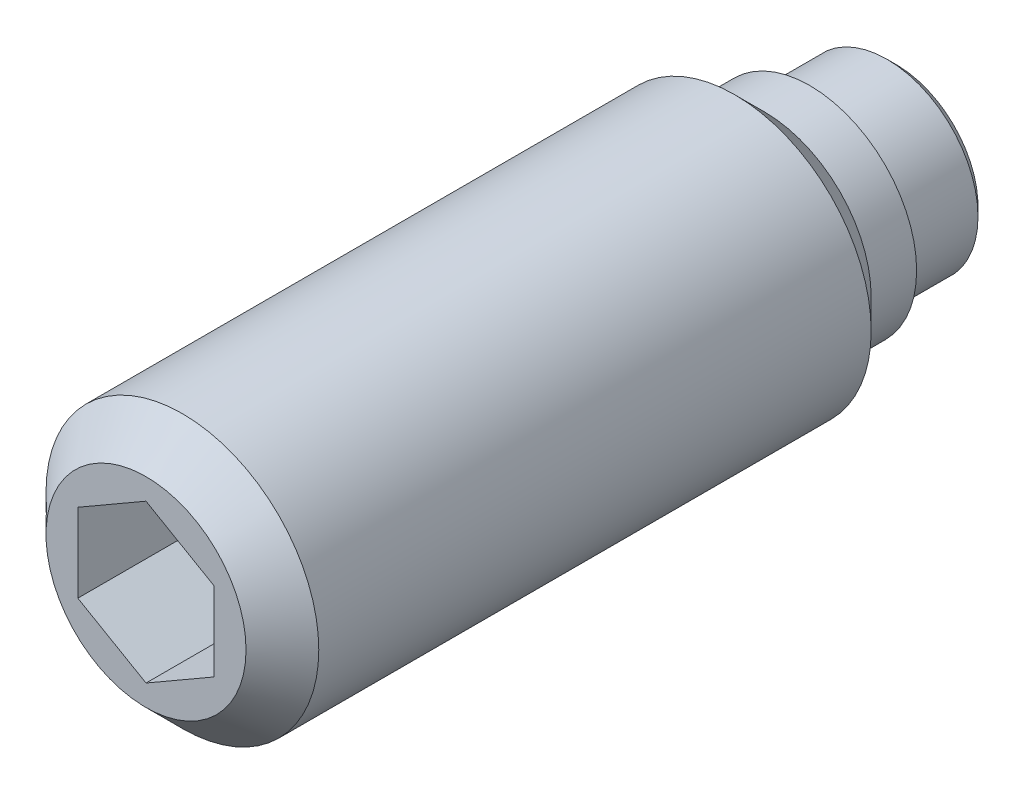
ISO-10303-21;
HEADER;
FILE_DESCRIPTION(('STEP AP214'),'2;1');
FILE_NAME('part.step','',(''),(''),'','','');
FILE_SCHEMA(('AUTOMOTIVE_DESIGN { 1 0 10303 214 1 1 1 1 }'));
ENDSEC;
DATA;
#1=APPLICATION_CONTEXT('core data for automotive mechanical design processes');
#2=APPLICATION_PROTOCOL_DEFINITION('international standard','automotive_design',2000,#1);
#3=PRODUCT_CONTEXT('',#1,'mechanical');
#4=PRODUCT('Part','Part','',(#3));
#5=PRODUCT_RELATED_PRODUCT_CATEGORY('part','',(#4));
#6=PRODUCT_DEFINITION_FORMATION('','',#4);
#7=PRODUCT_DEFINITION_CONTEXT('part definition',#1,'design');
#8=PRODUCT_DEFINITION('design','',#6,#7);
#9=PRODUCT_DEFINITION_SHAPE('','',#8);
#10=(LENGTH_UNIT() NAMED_UNIT(*) SI_UNIT(.MILLI.,.METRE.));
#11=(NAMED_UNIT(*) PLANE_ANGLE_UNIT() SI_UNIT($,.RADIAN.));
#12=(NAMED_UNIT(*) SI_UNIT($,.STERADIAN.) SOLID_ANGLE_UNIT());
#13=UNCERTAINTY_MEASURE_WITH_UNIT(LENGTH_MEASURE(1.E-05),#10,'distance_accuracy_value','');
#14=(GEOMETRIC_REPRESENTATION_CONTEXT(3) GLOBAL_UNCERTAINTY_ASSIGNED_CONTEXT((#13)) GLOBAL_UNIT_ASSIGNED_CONTEXT((#10,
#11,#12)) REPRESENTATION_CONTEXT('',''));
#15=CARTESIAN_POINT('',(0.,0.,0.));
#16=DIRECTION('',(0.,0.,1.));
#17=DIRECTION('',(1.,0.,0.));
#18=AXIS2_PLACEMENT_3D('',#15,#16,#17);
#19=CARTESIAN_POINT('',(0.,0.,1.9));
#20=DIRECTION('',(0.,0.,-1.));
#21=DIRECTION('',(-1.,0.,0.));
#22=AXIS2_PLACEMENT_3D('',#19,#20,#21);
#23=CYLINDRICAL_SURFACE('',#22,3.);
#24=CARTESIAN_POINT('',(0.,0.,15.7));
#25=DIRECTION('',(0.,0.,1.));
#26=DIRECTION('',(1.,0.,0.));
#27=AXIS2_PLACEMENT_3D('',#24,#25,#26);
#28=CIRCLE('',#27,3.);
#29=CARTESIAN_POINT('',(3.,0.,15.7));
#30=VERTEX_POINT('',#29);
#31=EDGE_CURVE('E9',#30,#30,#28,.F.);
#32=ORIENTED_EDGE('',*,*,#31,.T.);
#33=EDGE_LOOP('',(#32));
#34=FACE_BOUND('',#33,.T.);
#35=CARTESIAN_POINT('',(0.,0.,3.55));
#36=DIRECTION('',(0.,0.,-1.));
#37=DIRECTION('',(-1.,0.,0.));
#38=AXIS2_PLACEMENT_3D('',#35,#36,#37);
#39=CIRCLE('',#38,3.);
#40=CARTESIAN_POINT('',(-3.,0.,3.55));
#41=VERTEX_POINT('',#40);
#42=EDGE_CURVE('E74',#41,#41,#39,.T.);
#43=ORIENTED_EDGE('',*,*,#42,.F.);
#44=EDGE_LOOP('',(#43));
#45=FACE_BOUND('',#44,.T.);
#46=ADVANCED_FACE('F14',(#34,#45),#23,.T.);
#47=CARTESIAN_POINT('',(0.,0.,3.55));
#48=DIRECTION('',(0.,0.,1.));
#49=DIRECTION('',(1.,0.,0.));
#50=AXIS2_PLACEMENT_3D('',#47,#48,#49);
#51=CONICAL_SURFACE('',#50,3.,0.785398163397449);
#52=ORIENTED_EDGE('',*,*,#42,.T.);
#53=EDGE_LOOP('',(#52));
#54=FACE_BOUND('',#53,.T.);
#55=CARTESIAN_POINT('',(0.,0.,2.9));
#56=DIRECTION('',(0.,0.,-1.));
#57=DIRECTION('',(-1.,0.,0.));
#58=AXIS2_PLACEMENT_3D('',#55,#56,#57);
#59=CIRCLE('',#58,2.35);
#60=CARTESIAN_POINT('',(-2.35,0.,2.9));
#61=VERTEX_POINT('',#60);
#62=EDGE_CURVE('E112',#61,#61,#59,.T.);
#63=ORIENTED_EDGE('',*,*,#62,.F.);
#64=EDGE_LOOP('',(#63));
#65=FACE_BOUND('',#64,.T.);
#66=ADVANCED_FACE('F130',(#54,#65),#51,.T.);
#67=CARTESIAN_POINT('',(0.,0.,1.9));
#68=DIRECTION('',(0.,0.,-1.));
#69=DIRECTION('',(-1.,0.,0.));
#70=AXIS2_PLACEMENT_3D('',#67,#68,#69);
#71=CYLINDRICAL_SURFACE('',#70,2.35);
#72=ORIENTED_EDGE('',*,*,#62,.T.);
#73=EDGE_LOOP('',(#72));
#74=FACE_BOUND('',#73,.T.);
#75=CARTESIAN_POINT('',(0.,0.,1.9));
#76=DIRECTION('',(0.,0.,-1.));
#77=DIRECTION('',(-1.,0.,0.));
#78=AXIS2_PLACEMENT_3D('',#75,#76,#77);
#79=CIRCLE('',#78,2.35);
#80=CARTESIAN_POINT('',(-2.35,0.,1.9));
#81=VERTEX_POINT('',#80);
#82=EDGE_CURVE('E109',#81,#81,#79,.T.);
#83=ORIENTED_EDGE('',*,*,#82,.F.);
#84=EDGE_LOOP('',(#83));
#85=FACE_BOUND('',#84,.T.);
#86=ADVANCED_FACE('F135',(#74,#85),#71,.T.);
#87=CARTESIAN_POINT('',(0.,2.35,1.9));
#88=DIRECTION('',(0.,0.,1.));
#89=DIRECTION('',(1.,0.,0.));
#90=AXIS2_PLACEMENT_3D('',#87,#88,#89);
#91=PLANE('',#90);
#92=ORIENTED_EDGE('',*,*,#82,.T.);
#93=EDGE_LOOP('',(#92));
#94=FACE_BOUND('',#93,.T.);
#95=CARTESIAN_POINT('',(0.,0.,1.9));
#96=DIRECTION('',(0.,0.,-1.));
#97=DIRECTION('',(-1.,0.,0.));
#98=AXIS2_PLACEMENT_3D('',#95,#96,#97);
#99=CIRCLE('',#98,2.);
#100=CARTESIAN_POINT('',(-2.,0.,1.9));
#101=VERTEX_POINT('',#100);
#102=EDGE_CURVE('E106',#101,#101,#99,.T.);
#103=ORIENTED_EDGE('',*,*,#102,.F.);
#104=EDGE_LOOP('',(#103));
#105=FACE_BOUND('',#104,.T.);
#106=ADVANCED_FACE('F142',(#94,#105),#91,.F.);
#107=CARTESIAN_POINT('',(0.,0.,0.));
#108=DIRECTION('',(0.,0.,-1.));
#109=DIRECTION('',(-1.,0.,0.));
#110=AXIS2_PLACEMENT_3D('',#107,#108,#109);
#111=CYLINDRICAL_SURFACE('',#110,2.);
#112=CARTESIAN_POINT('',(0.,0.,0.2));
#113=DIRECTION('',(0.,0.,-1.));
#114=DIRECTION('',(-1.,0.,0.));
#115=AXIS2_PLACEMENT_3D('',#112,#113,#114);
#116=CIRCLE('',#115,2.);
#117=CARTESIAN_POINT('',(-2.,0.,0.2));
#118=VERTEX_POINT('',#117);
#119=EDGE_CURVE('E103',#118,#118,#116,.T.);
#120=ORIENTED_EDGE('',*,*,#119,.F.);
#121=EDGE_LOOP('',(#120));
#122=FACE_BOUND('',#121,.T.);
#123=ORIENTED_EDGE('',*,*,#102,.T.);
#124=EDGE_LOOP('',(#123));
#125=FACE_BOUND('',#124,.T.);
#126=ADVANCED_FACE('F146',(#122,#125),#111,.T.);
#127=CARTESIAN_POINT('',(0.,0.,0.2));
#128=DIRECTION('',(0.,0.,1.));
#129=DIRECTION('',(1.,0.,0.));
#130=AXIS2_PLACEMENT_3D('',#127,#128,#129);
#131=CONICAL_SURFACE('',#130,2.,0.785398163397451);
#132=CARTESIAN_POINT('',(0.,0.,0.));
#133=DIRECTION('',(0.,0.,-1.));
#134=DIRECTION('',(-1.,0.,0.));
#135=AXIS2_PLACEMENT_3D('',#132,#133,#134);
#136=CIRCLE('',#135,1.8);
#137=CARTESIAN_POINT('',(-1.8,0.,0.));
#138=VERTEX_POINT('',#137);
#139=EDGE_CURVE('E100',#138,#138,#136,.T.);
#140=ORIENTED_EDGE('',*,*,#139,.F.);
#141=EDGE_LOOP('',(#140));
#142=FACE_BOUND('',#141,.T.);
#143=ORIENTED_EDGE('',*,*,#119,.T.);
#144=EDGE_LOOP('',(#143));
#145=FACE_BOUND('',#144,.T.);
#146=ADVANCED_FACE('F150',(#142,#145),#131,.T.);
#147=CARTESIAN_POINT('',(0.,1.8,0.));
#148=DIRECTION('',(0.,0.,1.));
#149=DIRECTION('',(1.,0.,0.));
#150=AXIS2_PLACEMENT_3D('',#147,#148,#149);
#151=PLANE('',#150);
#152=ORIENTED_EDGE('',*,*,#139,.T.);
#153=EDGE_LOOP('',(#152));
#154=FACE_BOUND('',#153,.T.);
#155=ADVANCED_FACE('F154',(#154),#151,.F.);
#156=CARTESIAN_POINT('',(0.,0.,16.5));
#157=DIRECTION('',(0.,0.,1.));
#158=DIRECTION('',(1.,0.,0.));
#159=AXIS2_PLACEMENT_3D('',#156,#157,#158);
#160=PLANE('',#159);
#161=CARTESIAN_POINT('',(0.,0.,16.5));
#162=DIRECTION('',(0.,0.,1.));
#163=DIRECTION('',(1.,0.,0.));
#164=AXIS2_PLACEMENT_3D('',#161,#162,#163);
#165=CIRCLE('',#164,2.2);
#166=CARTESIAN_POINT('',(2.2,0.,16.5));
#167=VERTEX_POINT('',#166);
#168=EDGE_CURVE('E22',#167,#167,#165,.T.);
#169=ORIENTED_EDGE('',*,*,#168,.T.);
#170=EDGE_LOOP('',(#169));
#171=FACE_BOUND('',#170,.T.);
#172=DIRECTION('',(-0.866025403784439,0.5,0.));
#173=VECTOR('',#172,1.);
#174=CARTESIAN_POINT('',(-1.5,-0.866025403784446,16.5));
#175=LINE('',#174,#173);
#176=CARTESIAN_POINT('',(0.,-1.73205080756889,16.5));
#177=VERTEX_POINT('',#176);
#178=CARTESIAN_POINT('',(-1.5,-0.866025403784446,16.5));
#179=VERTEX_POINT('',#178);
#180=EDGE_CURVE('E69',#177,#179,#175,.T.);
#181=ORIENTED_EDGE('',*,*,#180,.T.);
#182=DIRECTION('',(0.,1.,0.));
#183=VECTOR('',#182,1.);
#184=CARTESIAN_POINT('',(-1.5,0.866025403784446,16.5));
#185=LINE('',#184,#183);
#186=CARTESIAN_POINT('',(-1.5,0.866025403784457,16.5));
#187=VERTEX_POINT('',#186);
#188=EDGE_CURVE('E84',#179,#187,#185,.T.);
#189=ORIENTED_EDGE('',*,*,#188,.T.);
#190=DIRECTION('',(0.866025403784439,0.5,0.));
#191=VECTOR('',#190,1.);
#192=CARTESIAN_POINT('',(0.,1.73205080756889,16.5));
#193=LINE('',#192,#191);
#194=CARTESIAN_POINT('',(0.,1.73205080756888,16.5));
#195=VERTEX_POINT('',#194);
#196=EDGE_CURVE('E301',#187,#195,#193,.T.);
#197=ORIENTED_EDGE('',*,*,#196,.T.);
#198=DIRECTION('',(0.866025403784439,-0.5,0.));
#199=VECTOR('',#198,1.);
#200=CARTESIAN_POINT('',(1.5,0.866025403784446,16.5));
#201=LINE('',#200,#199);
#202=CARTESIAN_POINT('',(1.5,0.866025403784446,16.5));
#203=VERTEX_POINT('',#202);
#204=EDGE_CURVE('E298',#195,#203,#201,.T.);
#205=ORIENTED_EDGE('',*,*,#204,.T.);
#206=DIRECTION('',(0.,-1.,0.));
#207=VECTOR('',#206,1.);
#208=CARTESIAN_POINT('',(1.5,-0.866025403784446,16.5));
#209=LINE('',#208,#207);
#210=CARTESIAN_POINT('',(1.5,-0.866025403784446,16.5));
#211=VERTEX_POINT('',#210);
#212=EDGE_CURVE('E29',#203,#211,#209,.T.);
#213=ORIENTED_EDGE('',*,*,#212,.T.);
#214=DIRECTION('',(-0.866025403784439,-0.5,0.));
#215=VECTOR('',#214,1.);
#216=CARTESIAN_POINT('',(0.,-1.73205080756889,16.5));
#217=LINE('',#216,#215);
#218=EDGE_CURVE('E66',#211,#177,#217,.T.);
#219=ORIENTED_EDGE('',*,*,#218,.T.);
#220=EDGE_LOOP('',(#181,#189,#197,#205,#213,#219));
#221=FACE_BOUND('',#220,.T.);
#222=ADVANCED_FACE('F68',(#171,#221),#160,.T.);
#223=CARTESIAN_POINT('',(0.,0.,13.));
#224=DIRECTION('',(0.,0.,1.));
#225=DIRECTION('',(1.,0.,0.));
#226=AXIS2_PLACEMENT_3D('',#223,#224,#225);
#227=PLANE('',#226);
#228=DIRECTION('',(0.,-1.,0.));
#229=VECTOR('',#228,1.);
#230=CARTESIAN_POINT('',(-1.5,0.866025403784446,13.));
#231=LINE('',#230,#229);
#232=CARTESIAN_POINT('',(-1.5,0.866025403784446,13.));
#233=VERTEX_POINT('',#232);
#234=CARTESIAN_POINT('',(-1.5,-0.866025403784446,13.));
#235=VERTEX_POINT('',#234);
#236=EDGE_CURVE('E83',#233,#235,#231,.T.);
#237=ORIENTED_EDGE('',*,*,#236,.T.);
#238=DIRECTION('',(0.866025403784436,-0.5,0.));
#239=VECTOR('',#238,1.);
#240=CARTESIAN_POINT('',(-1.5,-0.866025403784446,13.));
#241=LINE('',#240,#239);
#242=CARTESIAN_POINT('',(0.,-1.73205080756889,13.));
#243=VERTEX_POINT('',#242);
#244=EDGE_CURVE('E280',#235,#243,#241,.T.);
#245=ORIENTED_EDGE('',*,*,#244,.T.);
#246=DIRECTION('',(0.866025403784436,0.5,0.));
#247=VECTOR('',#246,1.);
#248=CARTESIAN_POINT('',(0.,-1.73205080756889,13.));
#249=LINE('',#248,#247);
#250=CARTESIAN_POINT('',(1.5,-0.866025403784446,13.));
#251=VERTEX_POINT('',#250);
#252=EDGE_CURVE('E88',#243,#251,#249,.T.);
#253=ORIENTED_EDGE('',*,*,#252,.T.);
#254=DIRECTION('',(0.,1.,0.));
#255=VECTOR('',#254,1.);
#256=CARTESIAN_POINT('',(1.5,-0.866025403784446,13.));
#257=LINE('',#256,#255);
#258=CARTESIAN_POINT('',(1.5,0.866025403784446,13.));
#259=VERTEX_POINT('',#258);
#260=EDGE_CURVE('E287',#251,#259,#257,.T.);
#261=ORIENTED_EDGE('',*,*,#260,.T.);
#262=DIRECTION('',(-0.866025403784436,0.5,0.));
#263=VECTOR('',#262,1.);
#264=CARTESIAN_POINT('',(1.5,0.866025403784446,13.));
#265=LINE('',#264,#263);
#266=CARTESIAN_POINT('',(0.,1.73205080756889,13.));
#267=VERTEX_POINT('',#266);
#268=EDGE_CURVE('E96',#259,#267,#265,.T.);
#269=ORIENTED_EDGE('',*,*,#268,.T.);
#270=DIRECTION('',(-0.866025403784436,-0.5,0.));
#271=VECTOR('',#270,1.);
#272=CARTESIAN_POINT('',(0.,1.73205080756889,13.));
#273=LINE('',#272,#271);
#274=EDGE_CURVE('E91',#267,#233,#273,.T.);
#275=ORIENTED_EDGE('',*,*,#274,.T.);
#276=EDGE_LOOP('',(#237,#245,#253,#261,#269,#275));
#277=FACE_BOUND('',#276,.T.);
#278=ADVANCED_FACE('F162',(#277),#227,.T.);
#279=CARTESIAN_POINT('',(0.,-1.73205080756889,23.));
#280=DIRECTION('',(0.5,-0.866025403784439,0.));
#281=DIRECTION('',(0.866025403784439,0.5,0.));
#282=AXIS2_PLACEMENT_3D('',#279,#280,#281);
#283=PLANE('',#282);
#284=ORIENTED_EDGE('',*,*,#218,.F.);
#285=DIRECTION('',(0.,0.,1.));
#286=VECTOR('',#285,1.);
#287=CARTESIAN_POINT('',(1.5,-0.866025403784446,23.));
#288=LINE('',#287,#286);
#289=EDGE_CURVE('E90',#251,#211,#288,.T.);
#290=ORIENTED_EDGE('',*,*,#289,.F.);
#291=ORIENTED_EDGE('',*,*,#252,.F.);
#292=DIRECTION('',(0.,0.,1.));
#293=VECTOR('',#292,1.);
#294=CARTESIAN_POINT('',(0.,-1.73205080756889,23.));
#295=LINE('',#294,#293);
#296=EDGE_CURVE('E80',#243,#177,#295,.T.);
#297=ORIENTED_EDGE('',*,*,#296,.T.);
#298=EDGE_LOOP('',(#284,#290,#291,#297));
#299=FACE_BOUND('',#298,.T.);
#300=ADVANCED_FACE('F86',(#299),#283,.F.);
#301=CARTESIAN_POINT('',(1.5,-0.866025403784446,23.));
#302=DIRECTION('',(1.,0.,0.));
#303=DIRECTION('',(0.,0.,-1.));
#304=AXIS2_PLACEMENT_3D('',#301,#302,#303);
#305=PLANE('',#304);
#306=ORIENTED_EDGE('',*,*,#212,.F.);
#307=DIRECTION('',(0.,0.,1.));
#308=VECTOR('',#307,1.);
#309=CARTESIAN_POINT('',(1.5,0.866025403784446,23.));
#310=LINE('',#309,#308);
#311=EDGE_CURVE('E93',#259,#203,#310,.T.);
#312=ORIENTED_EDGE('',*,*,#311,.F.);
#313=ORIENTED_EDGE('',*,*,#260,.F.);
#314=ORIENTED_EDGE('',*,*,#289,.T.);
#315=EDGE_LOOP('',(#306,#312,#313,#314));
#316=FACE_BOUND('',#315,.T.);
#317=ADVANCED_FACE('F161',(#316),#305,.F.);
#318=CARTESIAN_POINT('',(1.5,0.866025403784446,23.));
#319=DIRECTION('',(0.5,0.866025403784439,0.));
#320=DIRECTION('',(-0.866025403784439,0.5,0.));
#321=AXIS2_PLACEMENT_3D('',#318,#319,#320);
#322=PLANE('',#321);
#323=ORIENTED_EDGE('',*,*,#204,.F.);
#324=DIRECTION('',(0.,0.,1.));
#325=VECTOR('',#324,1.);
#326=CARTESIAN_POINT('',(0.,1.73205080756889,23.));
#327=LINE('',#326,#325);
#328=EDGE_CURVE('E293',#267,#195,#327,.T.);
#329=ORIENTED_EDGE('',*,*,#328,.F.);
#330=ORIENTED_EDGE('',*,*,#268,.F.);
#331=ORIENTED_EDGE('',*,*,#311,.T.);
#332=EDGE_LOOP('',(#323,#329,#330,#331));
#333=FACE_BOUND('',#332,.T.);
#334=ADVANCED_FACE('F165',(#333),#322,.F.);
#335=CARTESIAN_POINT('',(0.,1.73205080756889,23.));
#336=DIRECTION('',(-0.5,0.866025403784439,0.));
#337=DIRECTION('',(-0.866025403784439,-0.5,0.));
#338=AXIS2_PLACEMENT_3D('',#335,#336,#337);
#339=PLANE('',#338);
#340=ORIENTED_EDGE('',*,*,#196,.F.);
#341=DIRECTION('',(0.,0.,1.));
#342=VECTOR('',#341,1.);
#343=CARTESIAN_POINT('',(-1.5,0.866025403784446,23.));
#344=LINE('',#343,#342);
#345=EDGE_CURVE('E37',#233,#187,#344,.T.);
#346=ORIENTED_EDGE('',*,*,#345,.F.);
#347=ORIENTED_EDGE('',*,*,#274,.F.);
#348=ORIENTED_EDGE('',*,*,#328,.T.);
#349=EDGE_LOOP('',(#340,#346,#347,#348));
#350=FACE_BOUND('',#349,.T.);
#351=ADVANCED_FACE('F169',(#350),#339,.F.);
#352=CARTESIAN_POINT('',(-1.5,0.866025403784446,23.));
#353=DIRECTION('',(-1.,0.,0.));
#354=DIRECTION('',(0.,0.,1.));
#355=AXIS2_PLACEMENT_3D('',#352,#353,#354);
#356=PLANE('',#355);
#357=ORIENTED_EDGE('',*,*,#188,.F.);
#358=DIRECTION('',(0.,0.,1.));
#359=VECTOR('',#358,1.);
#360=CARTESIAN_POINT('',(-1.5,-0.866025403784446,23.));
#361=LINE('',#360,#359);
#362=EDGE_CURVE('E82',#235,#179,#361,.T.);
#363=ORIENTED_EDGE('',*,*,#362,.F.);
#364=ORIENTED_EDGE('',*,*,#236,.F.);
#365=ORIENTED_EDGE('',*,*,#345,.T.);
#366=EDGE_LOOP('',(#357,#363,#364,#365));
#367=FACE_BOUND('',#366,.T.);
#368=ADVANCED_FACE('F126',(#367),#356,.F.);
#369=CARTESIAN_POINT('',(-1.5,-0.866025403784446,23.));
#370=DIRECTION('',(-0.5,-0.866025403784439,0.));
#371=DIRECTION('',(0.866025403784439,-0.5,0.));
#372=AXIS2_PLACEMENT_3D('',#369,#370,#371);
#373=PLANE('',#372);
#374=ORIENTED_EDGE('',*,*,#180,.F.);
#375=ORIENTED_EDGE('',*,*,#296,.F.);
#376=ORIENTED_EDGE('',*,*,#244,.F.);
#377=ORIENTED_EDGE('',*,*,#362,.T.);
#378=EDGE_LOOP('',(#374,#375,#376,#377));
#379=FACE_BOUND('',#378,.T.);
#380=ADVANCED_FACE('F78',(#379),#373,.F.);
#381=CARTESIAN_POINT('',(0.,0.,16.5));
#382=DIRECTION('',(0.,0.,-1.));
#383=DIRECTION('',(-1.,0.,0.));
#384=AXIS2_PLACEMENT_3D('',#381,#382,#383);
#385=CONICAL_SURFACE('',#384,2.2,0.785398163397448);
#386=ORIENTED_EDGE('',*,*,#31,.F.);
#387=EDGE_LOOP('',(#386));
#388=FACE_BOUND('',#387,.T.);
#389=ORIENTED_EDGE('',*,*,#168,.F.);
#390=EDGE_LOOP('',(#389));
#391=FACE_BOUND('',#390,.T.);
#392=ADVANCED_FACE('F16',(#388,#391),#385,.T.);
#393=CLOSED_SHELL('',(#46,#66,#86,#106,#126,#146,#155,#222,#278,#300,#317,#334,#351,#368,#380,#392));
#394=MANIFOLD_SOLID_BREP('B1',#393);
#395=ADVANCED_BREP_SHAPE_REPRESENTATION('',(#18,#394),#14);
#396=SHAPE_DEFINITION_REPRESENTATION(#9,#395);
ENDSEC;
END-ISO-10303-21;
